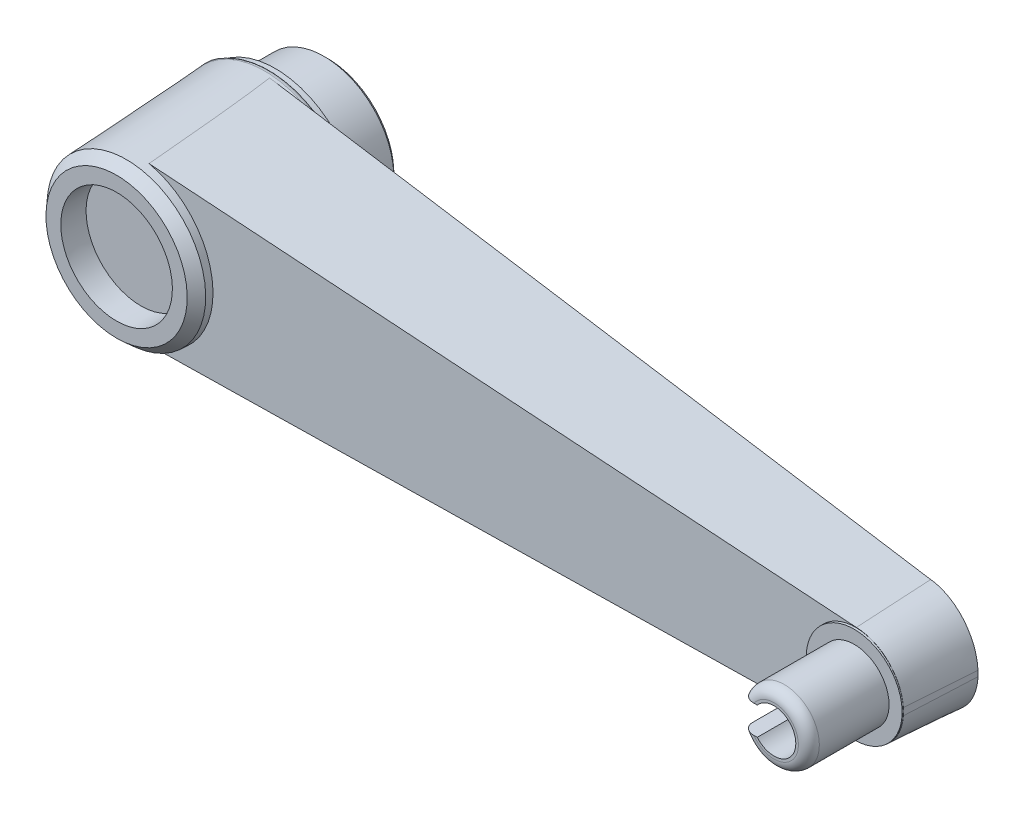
ISO-10303-21;
HEADER;
FILE_DESCRIPTION(('STEP AP214'),'2;1');
FILE_NAME('part.step','',(''),(''),'','','');
FILE_SCHEMA(('AUTOMOTIVE_DESIGN { 1 0 10303 214 1 1 1 1 }'));
ENDSEC;
DATA;
#1=APPLICATION_CONTEXT('core data for automotive mechanical design processes');
#2=APPLICATION_PROTOCOL_DEFINITION('international standard','automotive_design',2000,#1);
#3=PRODUCT_CONTEXT('',#1,'mechanical');
#4=PRODUCT('Part','Part','',(#3));
#5=PRODUCT_RELATED_PRODUCT_CATEGORY('part','',(#4));
#6=PRODUCT_DEFINITION_FORMATION('','',#4);
#7=PRODUCT_DEFINITION_CONTEXT('part definition',#1,'design');
#8=PRODUCT_DEFINITION('design','',#6,#7);
#9=PRODUCT_DEFINITION_SHAPE('','',#8);
#10=(LENGTH_UNIT() NAMED_UNIT(*) SI_UNIT(.MILLI.,.METRE.));
#11=(NAMED_UNIT(*) PLANE_ANGLE_UNIT() SI_UNIT($,.RADIAN.));
#12=(NAMED_UNIT(*) SI_UNIT($,.STERADIAN.) SOLID_ANGLE_UNIT());
#13=UNCERTAINTY_MEASURE_WITH_UNIT(LENGTH_MEASURE(1.E-05),#10,'distance_accuracy_value','');
#14=(GEOMETRIC_REPRESENTATION_CONTEXT(3) GLOBAL_UNCERTAINTY_ASSIGNED_CONTEXT((#13)) GLOBAL_UNIT_ASSIGNED_CONTEXT((#10,
#11,#12)) REPRESENTATION_CONTEXT('',''));
#15=CARTESIAN_POINT('',(0.,0.,0.));
#16=DIRECTION('',(0.,0.,1.));
#17=DIRECTION('',(1.,0.,0.));
#18=AXIS2_PLACEMENT_3D('',#15,#16,#17);
#19=CARTESIAN_POINT('',(212.,0.,69.));
#20=DIRECTION('',(0.,0.,1.));
#21=DIRECTION('',(0.,-1.,0.));
#22=AXIS2_PLACEMENT_3D('',#19,#20,#21);
#23=CYLINDRICAL_SURFACE('',#22,6.25);
#24=CARTESIAN_POINT('',(212.,0.,84.));
#25=DIRECTION('',(0.,0.,1.));
#26=DIRECTION('',(0.,-1.,0.));
#27=AXIS2_PLACEMENT_3D('',#24,#25,#26);
#28=CIRCLE('',#27,6.25);
#29=CARTESIAN_POINT('',(207.197656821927,-4.,84.));
#30=VERTEX_POINT('',#29);
#31=CARTESIAN_POINT('',(207.197656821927,4.,84.));
#32=VERTEX_POINT('',#31);
#33=EDGE_CURVE('E123',#30,#32,#28,.T.);
#34=ORIENTED_EDGE('',*,*,#33,.T.);
#35=DIRECTION('',(0.,0.,1.));
#36=VECTOR('',#35,1.);
#37=CARTESIAN_POINT('',(207.197656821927,4.,69.));
#38=LINE('',#37,#36);
#39=CARTESIAN_POINT('',(207.197656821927,4.,69.));
#40=VERTEX_POINT('',#39);
#41=EDGE_CURVE('E130',#40,#32,#38,.T.);
#42=ORIENTED_EDGE('',*,*,#41,.F.);
#43=CARTESIAN_POINT('',(212.,0.,69.));
#44=DIRECTION('',(0.,0.,1.));
#45=DIRECTION('',(0.,-1.,0.));
#46=AXIS2_PLACEMENT_3D('',#43,#44,#45);
#47=CIRCLE('',#46,6.25);
#48=CARTESIAN_POINT('',(207.197656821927,-4.,69.));
#49=VERTEX_POINT('',#48);
#50=EDGE_CURVE('E126',#49,#40,#47,.T.);
#51=ORIENTED_EDGE('',*,*,#50,.F.);
#52=DIRECTION('',(0.,0.,1.));
#53=VECTOR('',#52,1.);
#54=CARTESIAN_POINT('',(207.197656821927,-4.,69.));
#55=LINE('',#54,#53);
#56=EDGE_CURVE('E119',#49,#30,#55,.T.);
#57=ORIENTED_EDGE('',*,*,#56,.T.);
#58=EDGE_LOOP('',(#34,#42,#51,#57));
#59=FACE_BOUND('',#58,.T.);
#60=CARTESIAN_POINT('',(212.,-6.25,72.5));
#61=CARTESIAN_POINT('',(211.890630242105,-6.24999973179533,72.5000003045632));
#62=CARTESIAN_POINT('',(211.781256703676,-6.24710230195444,72.5090007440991));
#63=CARTESIAN_POINT('',(211.565716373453,-6.23582827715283,72.5446647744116));
#64=CARTESIAN_POINT('',(211.459550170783,-6.22745068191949,72.5713315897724));
#65=CARTESIAN_POINT('',(211.25356346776,-6.20612979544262,72.6413311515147));
#66=CARTESIAN_POINT('',(211.153733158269,-6.19319377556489,72.6846373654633));
#67=CARTESIAN_POINT('',(210.962751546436,-6.16408627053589,72.7865710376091));
#68=CARTESIAN_POINT('',(210.871601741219,-6.14791422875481,72.8452011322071));
#69=CARTESIAN_POINT('',(210.697631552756,-6.11346334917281,72.9781051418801));
#70=CARTESIAN_POINT('',(210.615129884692,-6.09513697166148,73.0527838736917));
#71=CARTESIAN_POINT('',(210.463582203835,-6.05871332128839,73.2148038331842));
#72=CARTESIAN_POINT('',(210.394538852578,-6.04061609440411,73.3021475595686));
#73=CARTESIAN_POINT('',(210.270107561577,-6.00618513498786,73.489816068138));
#74=CARTESIAN_POINT('',(210.215123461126,-5.98990982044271,73.5904203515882));
#75=CARTESIAN_POINT('',(210.122988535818,-5.96168322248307,73.8000529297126));
#76=CARTESIAN_POINT('',(210.085832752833,-5.9497307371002,73.9090788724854));
#77=CARTESIAN_POINT('',(210.031585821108,-5.93200153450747,74.1288532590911));
#78=CARTESIAN_POINT('',(210.01390128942,-5.9260426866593,74.2394401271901));
#79=CARTESIAN_POINT('',(209.997244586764,-5.9204353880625,74.4621594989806));
#80=CARTESIAN_POINT('',(209.998267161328,-5.92078516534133,74.574291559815));
#81=CARTESIAN_POINT('',(210.018532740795,-5.92759523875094,74.7919569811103));
#82=CARTESIAN_POINT('',(210.037014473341,-5.93380021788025,74.8975705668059));
#83=CARTESIAN_POINT('',(210.090436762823,-5.95120571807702,75.1041110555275));
#84=CARTESIAN_POINT('',(210.125379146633,-5.96240679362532,75.2050374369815));
#85=CARTESIAN_POINT('',(210.211254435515,-5.9887331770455,75.4011223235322));
#86=CARTESIAN_POINT('',(210.262421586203,-6.00391536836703,75.4961702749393));
#87=CARTESIAN_POINT('',(210.379131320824,-6.03646806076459,75.6765775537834));
#88=CARTESIAN_POINT('',(210.444677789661,-6.05383915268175,75.7619342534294));
#89=CARTESIAN_POINT('',(210.591993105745,-6.0898296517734,75.9248308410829));
#90=CARTESIAN_POINT('',(210.674388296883,-6.10846901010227,76.0018009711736));
#91=CARTESIAN_POINT('',(210.851148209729,-6.14416460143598,76.1409733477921));
#92=CARTESIAN_POINT('',(210.945513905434,-6.16122070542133,76.2031743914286));
#93=CARTESIAN_POINT('',(211.14467302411,-6.19202237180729,76.3114543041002));
#94=CARTESIAN_POINT('',(211.249548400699,-6.20573850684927,76.3573913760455));
#95=CARTESIAN_POINT('',(211.466080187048,-6.22810201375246,76.4307994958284));
#96=CARTESIAN_POINT('',(211.577734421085,-6.23675100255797,76.458276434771));
#97=CARTESIAN_POINT('',(211.799822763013,-6.24774280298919,76.4930000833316));
#98=CARTESIAN_POINT('',(211.910124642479,-6.25032575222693,76.5010175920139));
#99=CARTESIAN_POINT('',(212.130512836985,-6.24960819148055,76.4987759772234));
#100=CARTESIAN_POINT('',(212.240599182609,-6.24630858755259,76.4885196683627));
#101=CARTESIAN_POINT('',(212.454418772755,-6.23435475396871,76.4506373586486));
#102=CARTESIAN_POINT('',(212.558242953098,-6.22584358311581,76.4234751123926));
#103=CARTESIAN_POINT('',(212.759827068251,-6.20446982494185,76.3531227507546));
#104=CARTESIAN_POINT('',(212.857586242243,-6.19160669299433,76.3099306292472));
#105=CARTESIAN_POINT('',(213.046996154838,-6.16244413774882,76.2075362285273));
#106=CARTESIAN_POINT('',(213.138432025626,-6.14606657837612,76.1479593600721));
#107=CARTESIAN_POINT('',(213.310264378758,-6.11174260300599,76.0149326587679));
#108=CARTESIAN_POINT('',(213.390657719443,-6.09379574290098,75.9414788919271));
#109=CARTESIAN_POINT('',(213.541604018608,-6.05741209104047,75.7791573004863));
#110=CARTESIAN_POINT('',(213.611607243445,-6.03898605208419,75.6897746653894));
#111=CARTESIAN_POINT('',(213.735676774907,-6.00450553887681,75.5001316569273));
#112=CARTESIAN_POINT('',(213.78974321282,-5.98845104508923,75.3998713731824));
#113=CARTESIAN_POINT('',(213.880094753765,-5.96070328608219,75.1914455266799));
#114=CARTESIAN_POINT('',(213.916438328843,-5.94899571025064,75.0833073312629));
#115=CARTESIAN_POINT('',(213.970258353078,-5.9313910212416,74.8619909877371));
#116=CARTESIAN_POINT('',(213.987742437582,-5.92549155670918,74.74881489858));
#117=CARTESIAN_POINT('',(214.002781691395,-5.92042409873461,74.526405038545));
#118=CARTESIAN_POINT('',(214.001242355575,-5.92095023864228,74.4172387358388));
#119=CARTESIAN_POINT('',(213.980479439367,-5.92792698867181,74.2008037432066));
#120=CARTESIAN_POINT('',(213.961256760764,-5.9343772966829,74.0935349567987));
#121=CARTESIAN_POINT('',(213.906291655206,-5.9522567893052,73.8856457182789));
#122=CARTESIAN_POINT('',(213.870820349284,-5.96360409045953,73.7849460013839));
#123=CARTESIAN_POINT('',(213.784580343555,-5.98997469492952,73.590847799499));
#124=CARTESIAN_POINT('',(213.733808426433,-6.00499877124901,73.4974508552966));
#125=CARTESIAN_POINT('',(213.615990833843,-6.03779367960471,73.316487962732));
#126=CARTESIAN_POINT('',(213.548366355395,-6.05565148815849,73.2293146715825));
#127=CARTESIAN_POINT('',(213.399767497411,-6.09171476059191,73.0672603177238));
#128=CARTESIAN_POINT('',(213.318789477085,-6.1099203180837,72.9923826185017));
#129=CARTESIAN_POINT('',(213.142390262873,-6.14538885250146,72.8544271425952));
#130=CARTESIAN_POINT('',(213.046564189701,-6.16259689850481,72.7918513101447));
#131=CARTESIAN_POINT('',(212.845204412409,-6.19342234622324,72.6837747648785));
#132=CARTESIAN_POINT('',(212.73967407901,-6.20704098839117,72.6382681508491));
#133=CARTESIAN_POINT('',(212.529579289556,-6.22835426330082,72.568440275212));
#134=CARTESIAN_POINT('',(212.425470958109,-6.23639876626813,72.5428519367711));
#135=CARTESIAN_POINT('',(212.214242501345,-6.24722116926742,72.50863357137));
#136=CARTESIAN_POINT('',(212.107123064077,-6.25000026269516,72.4999997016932));
#137=CARTESIAN_POINT('',(212.,-6.25,72.5));
#138=B_SPLINE_CURVE_WITH_KNOTS('',3,(#60,#61,#62,#63,#64,#65,#66,#67,#68,#69,#70,#71,#72,#73,
#74,#75,#76,#77,#78,#79,#80,#81,#82,#83,#84,#85,#86,#87,#88,#89,#90,#91,#92,#93,#94,#95,#96,#97,
#98,#99,#100,#101,#102,#103,#104,#105,#106,#107,#108,#109,#110,#111,#112,#113,#114,#115,#116,
#117,#118,#119,#120,#121,#122,#123,#124,#125,#126,#127,#128,#129,#130,#131,#132,#133,#134,#135,
#136,#137),.UNSPECIFIED.,.T.,.F.,(4,2,2,2,2,2,2,2,2,2,2,2,2,2,2,2,2,2,2,2,2,2,2,2,2,2,2,2,2,2,2,
2,2,2,2,2,2,2,4),(0.,0.327715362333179,0.655490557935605,0.982745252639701,1.31005628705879,
1.64687147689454,1.98375320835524,2.32943536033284,2.67502132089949,3.00975612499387,
3.34439690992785,3.66508861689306,3.98581592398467,4.31140244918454,4.63707704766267,
4.97834106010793,5.31963285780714,5.66383089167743,6.00791903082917,6.33813763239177,
6.66830537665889,6.98979270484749,7.31132028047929,7.64091693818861,7.97060717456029,
8.31403741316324,8.65746482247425,8.99975138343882,9.34189931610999,9.66782668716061,
9.9937374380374,10.3143977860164,10.6351256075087,10.968921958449,11.3028094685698,
11.6483285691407,11.9937281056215,12.3147842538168,12.6357676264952),.UNSPECIFIED.);
#139=CARTESIAN_POINT('',(212.,-6.25,72.5));
#140=VERTEX_POINT('',#139);
#141=EDGE_CURVE('E28',#140,#140,#138,.T.);
#142=ORIENTED_EDGE('',*,*,#141,.F.);
#143=EDGE_LOOP('',(#142));
#144=FACE_BOUND('',#143,.T.);
#145=CARTESIAN_POINT('',(212.,6.25,72.5));
#146=CARTESIAN_POINT('',(212.109369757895,6.24999973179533,72.5000003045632));
#147=CARTESIAN_POINT('',(212.218743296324,6.24710230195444,72.5090007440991));
#148=CARTESIAN_POINT('',(212.434283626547,6.23582827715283,72.5446647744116));
#149=CARTESIAN_POINT('',(212.540449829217,6.22745068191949,72.5713315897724));
#150=CARTESIAN_POINT('',(212.74643653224,6.20612979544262,72.6413311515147));
#151=CARTESIAN_POINT('',(212.846266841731,6.19319377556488,72.6846373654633));
#152=CARTESIAN_POINT('',(213.037248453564,6.16408627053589,72.7865710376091));
#153=CARTESIAN_POINT('',(213.128398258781,6.14791422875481,72.8452011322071));
#154=CARTESIAN_POINT('',(213.302368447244,6.11346334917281,72.9781051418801));
#155=CARTESIAN_POINT('',(213.384870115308,6.09513697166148,73.0527838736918));
#156=CARTESIAN_POINT('',(213.536417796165,6.05871332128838,73.2148038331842));
#157=CARTESIAN_POINT('',(213.605461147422,6.04061609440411,73.3021475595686));
#158=CARTESIAN_POINT('',(213.729892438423,6.00618513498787,73.489816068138));
#159=CARTESIAN_POINT('',(213.784876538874,5.98990982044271,73.5904203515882));
#160=CARTESIAN_POINT('',(213.877011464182,5.96168322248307,73.8000529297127));
#161=CARTESIAN_POINT('',(213.914167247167,5.9497307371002,73.9090788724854));
#162=CARTESIAN_POINT('',(213.968414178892,5.93200153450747,74.1288532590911));
#163=CARTESIAN_POINT('',(213.98609871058,5.9260426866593,74.2394401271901));
#164=CARTESIAN_POINT('',(214.002755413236,5.9204353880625,74.4621594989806));
#165=CARTESIAN_POINT('',(214.001732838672,5.92078516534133,74.574291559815));
#166=CARTESIAN_POINT('',(213.981467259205,5.92759523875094,74.7919569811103));
#167=CARTESIAN_POINT('',(213.962985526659,5.93380021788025,74.8975705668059));
#168=CARTESIAN_POINT('',(213.909563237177,5.95120571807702,75.1041110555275));
#169=CARTESIAN_POINT('',(213.874620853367,5.96240679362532,75.2050374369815));
#170=CARTESIAN_POINT('',(213.788745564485,5.9887331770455,75.4011223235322));
#171=CARTESIAN_POINT('',(213.737578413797,6.00391536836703,75.4961702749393));
#172=CARTESIAN_POINT('',(213.620868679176,6.03646806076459,75.6765775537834));
#173=CARTESIAN_POINT('',(213.555322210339,6.05383915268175,75.7619342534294));
#174=CARTESIAN_POINT('',(213.408006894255,6.08982965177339,75.9248308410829));
#175=CARTESIAN_POINT('',(213.325611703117,6.10846901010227,76.0018009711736));
#176=CARTESIAN_POINT('',(213.148851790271,6.14416460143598,76.1409733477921));
#177=CARTESIAN_POINT('',(213.054486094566,6.16122070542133,76.2031743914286));
#178=CARTESIAN_POINT('',(212.85532697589,6.19202237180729,76.3114543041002));
#179=CARTESIAN_POINT('',(212.750451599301,6.20573850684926,76.3573913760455));
#180=CARTESIAN_POINT('',(212.533919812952,6.22810201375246,76.4307994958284));
#181=CARTESIAN_POINT('',(212.422265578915,6.23675100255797,76.458276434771));
#182=CARTESIAN_POINT('',(212.200177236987,6.24774280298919,76.4930000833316));
#183=CARTESIAN_POINT('',(212.089875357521,6.25032575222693,76.5010175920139));
#184=CARTESIAN_POINT('',(211.869487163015,6.24960819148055,76.4987759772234));
#185=CARTESIAN_POINT('',(211.759400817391,6.24630858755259,76.4885196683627));
#186=CARTESIAN_POINT('',(211.545581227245,6.23435475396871,76.4506373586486));
#187=CARTESIAN_POINT('',(211.441757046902,6.22584358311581,76.4234751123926));
#188=CARTESIAN_POINT('',(211.240172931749,6.20446982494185,76.3531227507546));
#189=CARTESIAN_POINT('',(211.142413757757,6.19160669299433,76.3099306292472));
#190=CARTESIAN_POINT('',(210.953003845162,6.16244413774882,76.2075362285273));
#191=CARTESIAN_POINT('',(210.861567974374,6.14606657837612,76.1479593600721));
#192=CARTESIAN_POINT('',(210.689735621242,6.11174260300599,76.0149326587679));
#193=CARTESIAN_POINT('',(210.609342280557,6.09379574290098,75.9414788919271));
#194=CARTESIAN_POINT('',(210.458395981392,6.05741209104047,75.7791573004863));
#195=CARTESIAN_POINT('',(210.388392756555,6.03898605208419,75.6897746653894));
#196=CARTESIAN_POINT('',(210.264323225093,6.00450553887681,75.5001316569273));
#197=CARTESIAN_POINT('',(210.21025678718,5.98845104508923,75.3998713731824));
#198=CARTESIAN_POINT('',(210.119905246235,5.96070328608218,75.1914455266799));
#199=CARTESIAN_POINT('',(210.083561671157,5.94899571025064,75.0833073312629));
#200=CARTESIAN_POINT('',(210.029741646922,5.9313910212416,74.8619909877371));
#201=CARTESIAN_POINT('',(210.012257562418,5.92549155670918,74.74881489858));
#202=CARTESIAN_POINT('',(209.997218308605,5.92042409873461,74.526405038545));
#203=CARTESIAN_POINT('',(209.998757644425,5.92095023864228,74.4172387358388));
#204=CARTESIAN_POINT('',(210.019520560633,5.92792698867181,74.2008037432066));
#205=CARTESIAN_POINT('',(210.038743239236,5.9343772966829,74.0935349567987));
#206=CARTESIAN_POINT('',(210.093708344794,5.9522567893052,73.8856457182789));
#207=CARTESIAN_POINT('',(210.129179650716,5.96360409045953,73.7849460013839));
#208=CARTESIAN_POINT('',(210.215419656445,5.98997469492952,73.590847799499));
#209=CARTESIAN_POINT('',(210.266191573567,6.00499877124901,73.4974508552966));
#210=CARTESIAN_POINT('',(210.384009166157,6.03779367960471,73.316487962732));
#211=CARTESIAN_POINT('',(210.451633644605,6.05565148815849,73.2293146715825));
#212=CARTESIAN_POINT('',(210.600232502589,6.0917147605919,73.0672603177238));
#213=CARTESIAN_POINT('',(210.681210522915,6.1099203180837,72.9923826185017));
#214=CARTESIAN_POINT('',(210.857609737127,6.14538885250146,72.8544271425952));
#215=CARTESIAN_POINT('',(210.953435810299,6.16259689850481,72.7918513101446));
#216=CARTESIAN_POINT('',(211.154795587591,6.19342234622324,72.6837747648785));
#217=CARTESIAN_POINT('',(211.26032592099,6.20704098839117,72.6382681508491));
#218=CARTESIAN_POINT('',(211.470420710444,6.22835426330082,72.568440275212));
#219=CARTESIAN_POINT('',(211.574529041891,6.23639876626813,72.5428519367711));
#220=CARTESIAN_POINT('',(211.785757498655,6.24722116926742,72.50863357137));
#221=CARTESIAN_POINT('',(211.892876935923,6.25000026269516,72.4999997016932));
#222=CARTESIAN_POINT('',(212.,6.25,72.5));
#223=B_SPLINE_CURVE_WITH_KNOTS('',3,(#145,#146,#147,#148,#149,#150,#151,#152,#153,#154,#155,
#156,#157,#158,#159,#160,#161,#162,#163,#164,#165,#166,#167,#168,#169,#170,#171,#172,#173,#174,
#175,#176,#177,#178,#179,#180,#181,#182,#183,#184,#185,#186,#187,#188,#189,#190,#191,#192,#193,
#194,#195,#196,#197,#198,#199,#200,#201,#202,#203,#204,#205,#206,#207,#208,#209,#210,#211,#212,
#213,#214,#215,#216,#217,#218,#219,#220,#221,#222),.UNSPECIFIED.,.T.,.F.,(4,2,2,2,2,2,2,2,2,2,2,
2,2,2,2,2,2,2,2,2,2,2,2,2,2,2,2,2,2,2,2,2,2,2,2,2,2,2,4),(0.,0.327715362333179,
0.655490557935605,0.982745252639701,1.31005628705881,1.64687147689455,1.98375320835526,
2.32943536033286,2.6750213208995,3.00975612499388,3.34439690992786,3.66508861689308,
3.9858159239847,4.31140244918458,4.63707704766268,4.9783410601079,5.31963285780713,
5.66383089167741,6.00791903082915,6.33813763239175,6.6683053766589,6.98979270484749,
7.31132028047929,7.64091693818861,7.97060717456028,8.31403741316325,8.65746482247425,
8.99975138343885,9.34189931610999,9.66782668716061,9.9937374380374,10.3143977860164,
10.6351256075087,10.968921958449,11.3028094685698,11.6483285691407,11.9937281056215,
12.3147842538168,12.6357676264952),.UNSPECIFIED.);
#224=CARTESIAN_POINT('',(212.,6.25,72.5));
#225=VERTEX_POINT('',#224);
#226=EDGE_CURVE('E9',#225,#225,#223,.T.);
#227=ORIENTED_EDGE('',*,*,#226,.F.);
#228=EDGE_LOOP('',(#227));
#229=FACE_BOUND('',#228,.T.);
#230=ADVANCED_FACE('F14',(#59,#144,#229),#23,.F.);
#231=CARTESIAN_POINT('',(-20.25,0.,60.5));
#232=DIRECTION('',(0.,0.,-1.));
#233=DIRECTION('',(0.,1.,0.));
#234=AXIS2_PLACEMENT_3D('',#231,#232,#233);
#235=PLANE('',#234);
#236=CARTESIAN_POINT('',(0.,0.,60.5));
#237=DIRECTION('',(0.,0.,1.));
#238=DIRECTION('',(0.,-1.,0.));
#239=AXIS2_PLACEMENT_3D('',#236,#237,#238);
#240=CIRCLE('',#239,20.25);
#241=CARTESIAN_POINT('',(0.,-20.25,60.5));
#242=VERTEX_POINT('',#241);
#243=EDGE_CURVE('E310',#242,#242,#240,.T.);
#244=ORIENTED_EDGE('',*,*,#243,.T.);
#245=EDGE_LOOP('',(#244));
#246=FACE_BOUND('',#245,.T.);
#247=CARTESIAN_POINT('',(0.,0.,60.5));
#248=DIRECTION('',(0.,0.,1.));
#249=DIRECTION('',(0.,-1.,0.));
#250=AXIS2_PLACEMENT_3D('',#247,#248,#249);
#251=CIRCLE('',#250,16.);
#252=CARTESIAN_POINT('',(0.,-16.,60.5));
#253=VERTEX_POINT('',#252);
#254=EDGE_CURVE('E274',#253,#253,#251,.T.);
#255=ORIENTED_EDGE('',*,*,#254,.F.);
#256=EDGE_LOOP('',(#255));
#257=FACE_BOUND('',#256,.T.);
#258=ADVANCED_FACE('F228',(#246,#257),#235,.F.);
#259=CARTESIAN_POINT('',(-25.,-25.,16.30400452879));
#260=DIRECTION('',(-0.0955561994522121,0.,0.995424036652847));
#261=DIRECTION('',(-0.995424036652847,0.,-0.0955561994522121));
#262=AXIS2_PLACEMENT_3D('',#259,#260,#261);
#263=PLANE('',#262);
#264=DIRECTION('',(0.994379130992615,0.0458073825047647,0.095455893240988));
#265=VECTOR('',#264,1.);
#266=CARTESIAN_POINT('',(-24.9540418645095,-26.0068451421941,16.3084163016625));
#267=LINE('',#266,#265);
#268=CARTESIAN_POINT('',(211.973322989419,-15.0924744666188,39.0523703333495));
#269=VERTEX_POINT('',#268);
#270=CARTESIAN_POINT('',(2.29174502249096,-24.7517321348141,18.923888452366));
#271=VERTEX_POINT('',#270);
#272=EDGE_CURVE('E371',#269,#271,#267,.F.);
#273=ORIENTED_EDGE('',*,*,#272,.T.);
#274=CARTESIAN_POINT('',(-0.129764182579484,0.,18.691434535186));
#275=DIRECTION('',(-0.0955561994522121,0.,0.995424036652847));
#276=DIRECTION('',(-0.995424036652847,0.,-0.0955561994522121));
#277=AXIS2_PLACEMENT_3D('',#274,#275,#276);
#278=ELLIPSE('',#277,24.9845642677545,24.8698972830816);
#279=CARTESIAN_POINT('',(2.29174502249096,24.7517321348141,18.923888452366));
#280=VERTEX_POINT('',#279);
#281=EDGE_CURVE('E319',#271,#280,#278,.T.);
#282=ORIENTED_EDGE('',*,*,#281,.T.);
#283=DIRECTION('',(-0.994379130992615,0.0458073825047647,-0.095455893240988));
#284=VECTOR('',#283,1.);
#285=CARTESIAN_POINT('',(-22.6765466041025,25.9019293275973,16.5270455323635));
#286=LINE('',#285,#284);
#287=CARTESIAN_POINT('',(211.973322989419,15.0924744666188,39.0523703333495));
#288=VERTEX_POINT('',#287);
#289=EDGE_CURVE('E338',#280,#288,#286,.F.);
#290=ORIENTED_EDGE('',*,*,#289,.T.);
#291=CARTESIAN_POINT('',(211.913922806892,0.,39.046668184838));
#292=DIRECTION('',(-0.0955561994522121,0.,0.995424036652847));
#293=DIRECTION('',(-0.995424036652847,0.,-0.0955561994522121));
#294=AXIS2_PLACEMENT_3D('',#291,#292,#293);
#295=ELLIPSE('',#294,15.1622185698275,15.0925913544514);
#296=CARTESIAN_POINT('',(226.986006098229,0.791206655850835,40.4935199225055));
#297=VERTEX_POINT('',#296);
#298=EDGE_CURVE('E198',#297,#288,#295,.T.);
#299=ORIENTED_EDGE('',*,*,#298,.F.);
#300=DIRECTION('',(0.,1.,0.));
#301=VECTOR('',#300,1.);
#302=CARTESIAN_POINT('',(226.986006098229,-25.,40.4935199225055));
#303=LINE('',#302,#301);
#304=CARTESIAN_POINT('',(226.986006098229,-0.791206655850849,40.4935199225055));
#305=VERTEX_POINT('',#304);
#306=EDGE_CURVE('E363',#305,#297,#303,.T.);
#307=ORIENTED_EDGE('',*,*,#306,.F.);
#308=EDGE_CURVE('E350',#269,#305,#295,.T.);
#309=ORIENTED_EDGE('',*,*,#308,.F.);
#310=EDGE_LOOP('',(#273,#282,#290,#299,#307,#309));
#311=FACE_BOUND('',#310,.T.);
#312=ADVANCED_FACE('F184',(#311),#263,.F.);
#313=CARTESIAN_POINT('',(0.,-25.,16.30400452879));
#314=DIRECTION('',(0.0402546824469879,-0.997427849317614,0.0593063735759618));
#315=DIRECTION('',(0.,-0.0593544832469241,-0.998236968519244));
#316=AXIS2_PLACEMENT_3D('',#313,#314,#315);
#317=PLANE('',#316);
#318=DIRECTION('',(-0.998829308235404,-0.0417626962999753,-0.0244108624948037));
#319=VECTOR('',#318,1.);
#320=CARTESIAN_POINT('',(225.279604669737,-13.2706431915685,60.660589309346));
#321=LINE('',#320,#319);
#322=CARTESIAN_POINT('',(4.05779145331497,-22.5202910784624,55.25404464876));
#323=VERTEX_POINT('',#322);
#324=CARTESIAN_POINT('',(211.949517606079,-13.8279960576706,60.3348089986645));
#325=VERTEX_POINT('',#324);
#326=EDGE_CURVE('E356',#323,#325,#321,.F.);
#327=ORIENTED_EDGE('',*,*,#326,.F.);
#328=CARTESIAN_POINT('',(0.485870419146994,-12.0388649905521,233.957482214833));
#329=DIRECTION('',(0.0402546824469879,-0.997427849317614,0.0593063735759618));
#330=DIRECTION('',(0.00239156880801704,-0.059258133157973,-0.998239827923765));
#331=AXIS2_PLACEMENT_3D('',#328,#329,#330);
#332=ELLIPSE('',#331,222.064873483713,5.31741796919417);
#333=EDGE_CURVE('E316',#323,#271,#332,.F.);
#334=ORIENTED_EDGE('',*,*,#333,.T.);
#335=ORIENTED_EDGE('',*,*,#272,.F.);
#336=CARTESIAN_POINT('',(211.949149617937,-13.807928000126,60.6725678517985));
#337=CARTESIAN_POINT('',(211.958621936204,-14.3233358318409,51.9978943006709));
#338=CARTESIAN_POINT('',(211.968369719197,-14.8387325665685,43.3232204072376));
#339=CARTESIAN_POINT('',(211.985458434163,-15.7174176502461,28.5336991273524));
#340=CARTESIAN_POINT('',(211.992660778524,-16.0807115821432,22.4188519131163));
#341=CARTESIAN_POINT('',(212.,-16.444,16.30400452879));
#342=B_SPLINE_CURVE_WITH_KNOTS('',3,(#336,#337,#338,#339,#340,#341),.UNSPECIFIED.,.F.,.F.,(4,2,
4),(0.,26.069930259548,44.4468319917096),.UNSPECIFIED.);
#343=EDGE_CURVE('E189',#325,#269,#342,.T.);
#344=ORIENTED_EDGE('',*,*,#343,.F.);
#345=EDGE_LOOP('',(#327,#334,#335,#344));
#346=FACE_BOUND('',#345,.T.);
#347=ADVANCED_FACE('F179',(#346),#317,.T.);
#348=CARTESIAN_POINT('',(212.,16.444,16.30400452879));
#349=DIRECTION('',(0.0402546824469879,0.997427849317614,0.0593063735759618));
#350=DIRECTION('',(0.,-0.0593544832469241,0.998236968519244));
#351=AXIS2_PLACEMENT_3D('',#348,#349,#350);
#352=PLANE('',#351);
#353=ORIENTED_EDGE('',*,*,#289,.F.);
#354=CARTESIAN_POINT('',(0.485870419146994,12.0388649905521,233.957482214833));
#355=DIRECTION('',(0.0402546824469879,0.997427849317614,0.0593063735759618));
#356=DIRECTION('',(0.00239156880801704,0.059258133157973,-0.998239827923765));
#357=AXIS2_PLACEMENT_3D('',#354,#355,#356);
#358=ELLIPSE('',#357,222.064873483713,5.31741796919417);
#359=CARTESIAN_POINT('',(4.05779145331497,22.5202910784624,55.25404464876));
#360=VERTEX_POINT('',#359);
#361=EDGE_CURVE('E313',#280,#360,#358,.F.);
#362=ORIENTED_EDGE('',*,*,#361,.T.);
#363=DIRECTION('',(0.998829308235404,-0.0417626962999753,0.0244108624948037));
#364=VECTOR('',#363,1.);
#365=CARTESIAN_POINT('',(227.365294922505,13.1834370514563,60.7115624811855));
#366=LINE('',#365,#364);
#367=CARTESIAN_POINT('',(211.949517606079,13.8279960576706,60.3348089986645));
#368=VERTEX_POINT('',#367);
#369=EDGE_CURVE('E340',#368,#360,#366,.F.);
#370=ORIENTED_EDGE('',*,*,#369,.F.);
#371=CARTESIAN_POINT('',(211.949149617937,13.807928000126,60.6725678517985));
#372=CARTESIAN_POINT('',(211.958621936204,14.3233358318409,51.9978943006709));
#373=CARTESIAN_POINT('',(211.968369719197,14.8387325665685,43.3232204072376));
#374=CARTESIAN_POINT('',(211.985458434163,15.7174176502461,28.5336991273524));
#375=CARTESIAN_POINT('',(211.992660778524,16.0807115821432,22.4188519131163));
#376=CARTESIAN_POINT('',(212.,16.444,16.30400452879));
#377=B_SPLINE_CURVE_WITH_KNOTS('',3,(#371,#372,#373,#374,#375,#376),.UNSPECIFIED.,.F.,.F.,(4,2,
4),(0.,26.069930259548,44.4468319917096),.UNSPECIFIED.);
#378=EDGE_CURVE('E199',#368,#288,#377,.T.);
#379=ORIENTED_EDGE('',*,*,#378,.T.);
#380=EDGE_LOOP('',(#353,#362,#370,#379));
#381=FACE_BOUND('',#380,.T.);
#382=ADVANCED_FACE('F183',(#381),#352,.T.);
#383=CARTESIAN_POINT('',(212.,0.,16.30400452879));
#384=DIRECTION('',(0.,0.,-1.));
#385=DIRECTION('',(0.,1.,0.));
#386=AXIS2_PLACEMENT_3D('',#383,#384,#385);
#387=CONICAL_SURFACE('',#386,16.444,0.0593411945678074);
#388=CARTESIAN_POINT('',(220.16260637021,0.,153.700008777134));
#389=DIRECTION('',(-0.998188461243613,0.,-0.0601647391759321));
#390=DIRECTION('',(0.0601647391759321,0.,-0.998188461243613));
#391=AXIS2_PLACEMENT_3D('',#388,#389,#390);
#392=ELLIPSE('',#391,137.641638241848,1.3963122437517);
#393=CARTESIAN_POINT('',(225.769735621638,-1.02754188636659,60.6725678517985));
#394=VERTEX_POINT('',#393);
#395=EDGE_CURVE('E366',#305,#394,#392,.T.);
#396=ORIENTED_EDGE('',*,*,#395,.T.);
#397=CARTESIAN_POINT('',(211.979922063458,0.,60.3355520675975));
#398=DIRECTION('',(0.0244321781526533,0.,-0.999701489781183));
#399=DIRECTION('',(-0.999701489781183,0.,-0.0244321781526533));
#400=AXIS2_PLACEMENT_3D('',#397,#398,#399);
#401=ELLIPSE('',#400,13.8321731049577,13.8280294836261);
#402=EDGE_CURVE('E351',#394,#325,#401,.T.);
#403=ORIENTED_EDGE('',*,*,#402,.T.);
#404=ORIENTED_EDGE('',*,*,#343,.T.);
#405=ORIENTED_EDGE('',*,*,#308,.T.);
#406=EDGE_LOOP('',(#396,#403,#404,#405));
#407=FACE_BOUND('',#406,.T.);
#408=ADVANCED_FACE('F206',(#407),#387,.T.);
#409=ORIENTED_EDGE('',*,*,#378,.F.);
#410=CARTESIAN_POINT('',(225.769735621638,1.02754188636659,60.6725678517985));
#411=VERTEX_POINT('',#410);
#412=EDGE_CURVE('E345',#368,#411,#401,.T.);
#413=ORIENTED_EDGE('',*,*,#412,.T.);
#414=EDGE_CURVE('E347',#411,#297,#392,.T.);
#415=ORIENTED_EDGE('',*,*,#414,.T.);
#416=ORIENTED_EDGE('',*,*,#298,.T.);
#417=EDGE_LOOP('',(#409,#413,#415,#416));
#418=FACE_BOUND('',#417,.T.);
#419=ADVANCED_FACE('F210',(#418),#387,.T.);
#420=CARTESIAN_POINT('',(225.769735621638,-25.,60.6725678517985));
#421=DIRECTION('',(0.0244321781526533,0.,-0.999701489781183));
#422=DIRECTION('',(0.999701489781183,0.,0.0244321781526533));
#423=AXIS2_PLACEMENT_3D('',#420,#421,#422);
#424=PLANE('',#423);
#425=CARTESIAN_POINT('',(212.,0.,60.3360427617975));
#426=DIRECTION('',(0.0244321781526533,0.,-0.999701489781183));
#427=DIRECTION('',(0.999701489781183,0.,0.0244321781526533));
#428=AXIS2_PLACEMENT_3D('',#425,#426,#427);
#429=ELLIPSE('',#428,13.7541057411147,13.7500000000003);
#430=CARTESIAN_POINT('',(225.75,0.,60.6720855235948));
#431=VERTEX_POINT('',#430);
#432=EDGE_CURVE('E374',#431,#431,#429,.T.);
#433=ORIENTED_EDGE('',*,*,#432,.T.);
#434=EDGE_LOOP('',(#433));
#435=FACE_BOUND('',#434,.T.);
#436=ORIENTED_EDGE('',*,*,#369,.T.);
#437=CARTESIAN_POINT('',(-0.0304040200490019,0.,55.154131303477));
#438=DIRECTION('',(0.0244321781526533,0.,-0.999701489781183));
#439=DIRECTION('',(-0.999701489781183,0.,-0.0244321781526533));
#440=AXIS2_PLACEMENT_3D('',#437,#438,#439);
#441=ELLIPSE('',#440,22.8952102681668,22.8883556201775);
#442=EDGE_CURVE('E377',#360,#323,#441,.T.);
#443=ORIENTED_EDGE('',*,*,#442,.T.);
#444=ORIENTED_EDGE('',*,*,#326,.T.);
#445=ORIENTED_EDGE('',*,*,#402,.F.);
#446=DIRECTION('',(0.,1.,0.));
#447=VECTOR('',#446,1.);
#448=CARTESIAN_POINT('',(225.769735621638,-25.,60.6725678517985));
#449=LINE('',#448,#447);
#450=EDGE_CURVE('E360',#394,#411,#449,.T.);
#451=ORIENTED_EDGE('',*,*,#450,.T.);
#452=ORIENTED_EDGE('',*,*,#412,.F.);
#453=EDGE_LOOP('',(#436,#443,#444,#445,#451,#452));
#454=FACE_BOUND('',#453,.T.);
#455=ADVANCED_FACE('F213',(#435,#454),#424,.F.);
#456=CARTESIAN_POINT('',(226.986006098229,-25.,40.4935199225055));
#457=DIRECTION('',(-0.998188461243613,0.,-0.0601647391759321));
#458=DIRECTION('',(0.0601647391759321,0.,-0.998188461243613));
#459=AXIS2_PLACEMENT_3D('',#456,#457,#458);
#460=PLANE('',#459);
#461=ORIENTED_EDGE('',*,*,#395,.F.);
#462=ORIENTED_EDGE('',*,*,#306,.T.);
#463=ORIENTED_EDGE('',*,*,#414,.F.);
#464=ORIENTED_EDGE('',*,*,#450,.F.);
#465=EDGE_LOOP('',(#461,#462,#463,#464));
#466=FACE_BOUND('',#465,.T.);
#467=ADVANCED_FACE('F216',(#466),#460,.F.);
#468=CARTESIAN_POINT('',(212.,0.,89.2329567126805));
#469=DIRECTION('',(0.,0.,1.));
#470=DIRECTION('',(0.,-1.,0.));
#471=AXIS2_PLACEMENT_3D('',#468,#469,#470);
#472=CYLINDRICAL_SURFACE('',#471,13.7500000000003);
#473=CARTESIAN_POINT('',(212.,0.,61.));
#474=DIRECTION('',(0.,0.,1.));
#475=DIRECTION('',(0.,-1.,0.));
#476=AXIS2_PLACEMENT_3D('',#473,#474,#475);
#477=CIRCLE('',#476,13.7500000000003);
#478=CARTESIAN_POINT('',(212.,-13.7500000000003,61.));
#479=VERTEX_POINT('',#478);
#480=EDGE_CURVE('E324',#479,#479,#477,.T.);
#481=ORIENTED_EDGE('',*,*,#480,.F.);
#482=EDGE_LOOP('',(#481));
#483=FACE_BOUND('',#482,.T.);
#484=ORIENTED_EDGE('',*,*,#432,.F.);
#485=EDGE_LOOP('',(#484));
#486=FACE_BOUND('',#485,.T.);
#487=ADVANCED_FACE('F178',(#483,#486),#472,.T.);
#488=CARTESIAN_POINT('',(205.,0.,84.));
#489=DIRECTION('',(0.,0.,-1.));
#490=DIRECTION('',(0.,1.,0.));
#491=AXIS2_PLACEMENT_3D('',#488,#489,#490);
#492=PLANE('',#491);
#493=CARTESIAN_POINT('',(212.,0.,84.));
#494=DIRECTION('',(0.,0.,1.));
#495=DIRECTION('',(0.,-1.,0.));
#496=AXIS2_PLACEMENT_3D('',#493,#494,#495);
#497=CIRCLE('',#496,7.00000000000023);
#498=CARTESIAN_POINT('',(206.255437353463,-4.,84.));
#499=VERTEX_POINT('',#498);
#500=CARTESIAN_POINT('',(206.255437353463,4.,84.));
#501=VERTEX_POINT('',#500);
#502=EDGE_CURVE('E332',#499,#501,#497,.T.);
#503=ORIENTED_EDGE('',*,*,#502,.T.);
#504=DIRECTION('',(-1.,0.,0.));
#505=VECTOR('',#504,1.);
#506=CARTESIAN_POINT('',(207.197656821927,4.,84.));
#507=LINE('',#506,#505);
#508=EDGE_CURVE('E140',#32,#501,#507,.T.);
#509=ORIENTED_EDGE('',*,*,#508,.F.);
#510=ORIENTED_EDGE('',*,*,#33,.F.);
#511=DIRECTION('',(-1.,0.,0.));
#512=VECTOR('',#511,1.);
#513=CARTESIAN_POINT('',(207.197656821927,-4.,84.));
#514=LINE('',#513,#512);
#515=EDGE_CURVE('E133',#30,#499,#514,.T.);
#516=ORIENTED_EDGE('',*,*,#515,.T.);
#517=EDGE_LOOP('',(#503,#509,#510,#516));
#518=FACE_BOUND('',#517,.T.);
#519=ADVANCED_FACE('F142',(#518),#492,.F.);
#520=CARTESIAN_POINT('',(212.,0.,81.));
#521=DIRECTION('',(0.,0.,1.));
#522=DIRECTION('',(0.,-1.,0.));
#523=AXIS2_PLACEMENT_3D('',#520,#521,#522);
#524=TOROIDAL_SURFACE('',#523,7.00000000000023,3.);
#525=CARTESIAN_POINT('',(204.365394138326,4.,78.474365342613));
#526=CARTESIAN_POINT('',(204.290014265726,4.,78.5171568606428));
#527=CARTESIAN_POINT('',(204.216294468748,4.,78.5628987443));
#528=CARTESIAN_POINT('',(204.072713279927,4.,78.6601444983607));
#529=CARTESIAN_POINT('',(204.002853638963,4.,78.7116509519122));
#530=CARTESIAN_POINT('',(203.867421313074,4.,78.8203916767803));
#531=CARTESIAN_POINT('',(203.801860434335,4.,78.8776407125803));
#532=CARTESIAN_POINT('',(203.675836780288,4.,78.9974495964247));
#533=CARTESIAN_POINT('',(203.615373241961,4.,79.0600086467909));
#534=CARTESIAN_POINT('',(203.442129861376,4.,79.2555991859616));
#535=CARTESIAN_POINT('',(203.337781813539,4.,79.3963171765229));
#536=CARTESIAN_POINT('',(203.15628143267,4.,79.6940362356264));
#537=CARTESIAN_POINT('',(203.07909167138,4.,79.8510145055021));
#538=CARTESIAN_POINT('',(202.958910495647,4.,80.1664103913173));
#539=CARTESIAN_POINT('',(202.914090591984,4.,80.3241311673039));
#540=CARTESIAN_POINT('',(202.853000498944,4.,80.6449774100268));
#541=CARTESIAN_POINT('',(202.836712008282,4.,80.8080993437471));
#542=CARTESIAN_POINT('',(202.833744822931,4.,81.0906880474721));
#543=CARTESIAN_POINT('',(202.840295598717,4.,81.2101278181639));
#544=CARTESIAN_POINT('',(202.868805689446,4.,81.4471351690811));
#545=CARTESIAN_POINT('',(202.890762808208,4.,81.5647030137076));
#546=CARTESIAN_POINT('',(202.960303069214,4.,81.8379274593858));
#547=CARTESIAN_POINT('',(203.014279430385,4.,81.9919948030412));
#548=CARTESIAN_POINT('',(203.147873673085,4.,82.2886617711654));
#549=CARTESIAN_POINT('',(203.22751670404,4.,82.4312499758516));
#550=CARTESIAN_POINT('',(203.409160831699,4.,82.7007693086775));
#551=CARTESIAN_POINT('',(203.511099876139,4.,82.8277423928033));
#552=CARTESIAN_POINT('',(203.733897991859,4.,83.063702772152));
#553=CARTESIAN_POINT('',(203.854754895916,4.,83.1726921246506));
#554=CARTESIAN_POINT('',(204.117905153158,4.,83.3757663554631));
#555=CARTESIAN_POINT('',(204.260955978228,4.,83.4688664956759));
#556=CARTESIAN_POINT('',(204.559464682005,4.,83.6323945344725));
#557=CARTESIAN_POINT('',(204.714928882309,4.,83.702810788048));
#558=CARTESIAN_POINT('',(205.051469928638,4.,83.8272758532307));
#559=CARTESIAN_POINT('',(205.233499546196,4.,83.8787354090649));
#560=CARTESIAN_POINT('',(205.602940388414,4.,83.9547146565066));
#561=CARTESIAN_POINT('',(205.790350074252,4.,83.9792419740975));
#562=CARTESIAN_POINT('',(206.111493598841,4.,83.9997326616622));
#563=CARTESIAN_POINT('',(206.244882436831,4.,84.0019553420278));
#564=CARTESIAN_POINT('',(206.511385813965,4.,83.9946880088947));
#565=CARTESIAN_POINT('',(206.644500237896,4.,83.9851938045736));
#566=CARTESIAN_POINT('',(206.91016085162,4.,83.9552819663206));
#567=CARTESIAN_POINT('',(207.042700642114,4.,83.9348086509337));
#568=CARTESIAN_POINT('',(207.305850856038,4.,83.8838343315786));
#569=CARTESIAN_POINT('',(207.436460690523,4.,83.8533303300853));
#570=CARTESIAN_POINT('',(207.753328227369,4.,83.7674854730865));
#571=CARTESIAN_POINT('',(207.938237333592,4.,83.7071426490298));
#572=CARTESIAN_POINT('',(208.302060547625,4.,83.5701175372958));
#573=CARTESIAN_POINT('',(208.480966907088,4.,83.4934150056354));
#574=CARTESIAN_POINT('',(208.829680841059,4.,83.3276091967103));
#575=CARTESIAN_POINT('',(208.999582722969,4.,83.2387018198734));
#576=CARTESIAN_POINT('',(209.332749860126,4.,83.0502738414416));
#577=CARTESIAN_POINT('',(209.496033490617,4.,82.9507858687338));
#578=CARTESIAN_POINT('',(209.656380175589,4.,82.847033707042));
#579=B_SPLINE_CURVE_WITH_KNOTS('',3,(#525,#526,#527,#528,#529,#530,#531,#532,#533,#534,#535,
#536,#537,#538,#539,#540,#541,#542,#543,#544,#545,#546,#547,#548,#549,#550,#551,#552,#553,#554,
#555,#556,#557,#558,#559,#560,#561,#562,#563,#564,#565,#566,#567,#568,#569,#570,#571,#572,#573,
#574,#575,#576,#577,#578),.UNSPECIFIED.,.F.,.F.,(4,2,2,2,2,2,2,2,2,2,2,2,2,2,2,2,2,2,2,2,2,2,2,
2,2,2,4),(0.,0.259988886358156,0.520094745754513,0.780887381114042,1.04164090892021,
1.56422550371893,2.08608704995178,2.57548908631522,3.06457708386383,3.42247214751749,
3.78031620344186,4.26747748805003,4.75511757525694,5.24141739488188,5.72766154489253,
6.23759342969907,6.74778667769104,7.31308462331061,7.87822246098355,8.27794529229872,
8.67781113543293,9.07972437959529,9.48175783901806,10.0643265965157,10.6476204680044,
11.222458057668,11.7955716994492),.UNSPECIFIED.);
#580=CARTESIAN_POINT('',(202.83484861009,4.,81.));
#581=VERTEX_POINT('',#580);
#582=EDGE_CURVE('E159',#501,#581,#579,.F.);
#583=ORIENTED_EDGE('',*,*,#582,.F.);
#584=ORIENTED_EDGE('',*,*,#502,.F.);
#585=CARTESIAN_POINT('',(204.365394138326,-4.,78.474365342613));
#586=CARTESIAN_POINT('',(204.290014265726,-4.,78.5171568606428));
#587=CARTESIAN_POINT('',(204.216294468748,-4.,78.5628987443));
#588=CARTESIAN_POINT('',(204.072713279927,-4.,78.6601444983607));
#589=CARTESIAN_POINT('',(204.002853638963,-4.,78.7116509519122));
#590=CARTESIAN_POINT('',(203.867421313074,-4.,78.8203916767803));
#591=CARTESIAN_POINT('',(203.801860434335,-4.,78.8776407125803));
#592=CARTESIAN_POINT('',(203.675836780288,-4.,78.9974495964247));
#593=CARTESIAN_POINT('',(203.615373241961,-4.,79.0600086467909));
#594=CARTESIAN_POINT('',(203.442129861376,-4.,79.2555991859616));
#595=CARTESIAN_POINT('',(203.337781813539,-4.,79.3963171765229));
#596=CARTESIAN_POINT('',(203.15628143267,-4.,79.6940362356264));
#597=CARTESIAN_POINT('',(203.07909167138,-4.,79.8510145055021));
#598=CARTESIAN_POINT('',(202.958910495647,-4.,80.1664103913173));
#599=CARTESIAN_POINT('',(202.914090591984,-4.,80.3241311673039));
#600=CARTESIAN_POINT('',(202.853000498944,-4.,80.6449774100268));
#601=CARTESIAN_POINT('',(202.836712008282,-4.,80.8080993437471));
#602=CARTESIAN_POINT('',(202.833744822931,-4.,81.0906880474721));
#603=CARTESIAN_POINT('',(202.840295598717,-4.,81.2101278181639));
#604=CARTESIAN_POINT('',(202.868805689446,-4.,81.4471351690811));
#605=CARTESIAN_POINT('',(202.890762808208,-4.,81.5647030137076));
#606=CARTESIAN_POINT('',(202.960303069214,-4.,81.8379274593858));
#607=CARTESIAN_POINT('',(203.014279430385,-4.,81.9919948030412));
#608=CARTESIAN_POINT('',(203.147873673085,-4.,82.2886617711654));
#609=CARTESIAN_POINT('',(203.22751670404,-4.,82.4312499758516));
#610=CARTESIAN_POINT('',(203.409160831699,-4.,82.7007693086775));
#611=CARTESIAN_POINT('',(203.511099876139,-4.,82.8277423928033));
#612=CARTESIAN_POINT('',(203.733897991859,-4.,83.063702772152));
#613=CARTESIAN_POINT('',(203.854754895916,-4.,83.1726921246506));
#614=CARTESIAN_POINT('',(204.117905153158,-4.,83.3757663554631));
#615=CARTESIAN_POINT('',(204.260955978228,-4.,83.4688664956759));
#616=CARTESIAN_POINT('',(204.559464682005,-4.,83.6323945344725));
#617=CARTESIAN_POINT('',(204.714928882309,-4.,83.702810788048));
#618=CARTESIAN_POINT('',(205.051469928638,-4.,83.8272758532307));
#619=CARTESIAN_POINT('',(205.233499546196,-4.,83.8787354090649));
#620=CARTESIAN_POINT('',(205.602940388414,-4.,83.9547146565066));
#621=CARTESIAN_POINT('',(205.790350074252,-4.,83.9792419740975));
#622=CARTESIAN_POINT('',(206.111493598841,-4.,83.9997326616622));
#623=CARTESIAN_POINT('',(206.244882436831,-4.,84.0019553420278));
#624=CARTESIAN_POINT('',(206.511385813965,-4.,83.9946880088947));
#625=CARTESIAN_POINT('',(206.644500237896,-4.,83.9851938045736));
#626=CARTESIAN_POINT('',(206.91016085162,-4.,83.9552819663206));
#627=CARTESIAN_POINT('',(207.042700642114,-4.,83.9348086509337));
#628=CARTESIAN_POINT('',(207.305850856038,-4.,83.8838343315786));
#629=CARTESIAN_POINT('',(207.436460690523,-4.,83.8533303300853));
#630=CARTESIAN_POINT('',(207.753328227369,-4.,83.7674854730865));
#631=CARTESIAN_POINT('',(207.938237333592,-4.,83.7071426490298));
#632=CARTESIAN_POINT('',(208.302060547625,-4.,83.5701175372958));
#633=CARTESIAN_POINT('',(208.480966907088,-4.,83.4934150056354));
#634=CARTESIAN_POINT('',(208.829680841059,-4.,83.3276091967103));
#635=CARTESIAN_POINT('',(208.999582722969,-4.,83.2387018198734));
#636=CARTESIAN_POINT('',(209.332749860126,-4.,83.0502738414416));
#637=CARTESIAN_POINT('',(209.496033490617,-4.,82.9507858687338));
#638=CARTESIAN_POINT('',(209.656380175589,-4.,82.847033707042));
#639=B_SPLINE_CURVE_WITH_KNOTS('',3,(#585,#586,#587,#588,#589,#590,#591,#592,#593,#594,#595,
#596,#597,#598,#599,#600,#601,#602,#603,#604,#605,#606,#607,#608,#609,#610,#611,#612,#613,#614,
#615,#616,#617,#618,#619,#620,#621,#622,#623,#624,#625,#626,#627,#628,#629,#630,#631,#632,#633,
#634,#635,#636,#637,#638),.UNSPECIFIED.,.F.,.F.,(4,2,2,2,2,2,2,2,2,2,2,2,2,2,2,2,2,2,2,2,2,2,2,
2,2,2,4),(0.,0.259988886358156,0.520094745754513,0.780887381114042,1.04164090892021,
1.56422550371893,2.08608704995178,2.57548908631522,3.06457708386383,3.42247214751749,
3.78031620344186,4.26747748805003,4.75511757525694,5.24141739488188,5.72766154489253,
6.23759342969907,6.74778667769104,7.31308462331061,7.87822246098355,8.27794529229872,
8.67781113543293,9.07972437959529,9.48175783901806,10.0643265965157,10.6476204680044,
11.222458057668,11.7955716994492),.UNSPECIFIED.);
#640=CARTESIAN_POINT('',(202.83484861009,-4.,81.));
#641=VERTEX_POINT('',#640);
#642=EDGE_CURVE('E136',#499,#641,#639,.F.);
#643=ORIENTED_EDGE('',*,*,#642,.T.);
#644=CARTESIAN_POINT('',(212.,0.,81.));
#645=DIRECTION('',(0.,0.,1.));
#646=DIRECTION('',(0.,-1.,0.));
#647=AXIS2_PLACEMENT_3D('',#644,#645,#646);
#648=CIRCLE('',#647,10.0000000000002);
#649=EDGE_CURVE('E330',#641,#581,#648,.T.);
#650=ORIENTED_EDGE('',*,*,#649,.T.);
#651=EDGE_LOOP('',(#583,#584,#643,#650));
#652=FACE_BOUND('',#651,.T.);
#653=ADVANCED_FACE('F167',(#652),#524,.T.);
#654=CARTESIAN_POINT('',(212.,0.,89.2329567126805));
#655=DIRECTION('',(0.,0.,1.));
#656=DIRECTION('',(0.,-1.,0.));
#657=AXIS2_PLACEMENT_3D('',#654,#655,#656);
#658=CYLINDRICAL_SURFACE('',#657,10.0000000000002);
#659=DIRECTION('',(0.,0.,1.));
#660=VECTOR('',#659,1.);
#661=CARTESIAN_POINT('',(202.83484861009,4.,89.2329567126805));
#662=LINE('',#661,#660);
#663=CARTESIAN_POINT('',(202.83484861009,4.,69.));
#664=VERTEX_POINT('',#663);
#665=EDGE_CURVE('E35',#581,#664,#662,.F.);
#666=ORIENTED_EDGE('',*,*,#665,.F.);
#667=ORIENTED_EDGE('',*,*,#649,.F.);
#668=DIRECTION('',(0.,0.,1.));
#669=VECTOR('',#668,1.);
#670=CARTESIAN_POINT('',(202.83484861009,-4.,89.2329567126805));
#671=LINE('',#670,#669);
#672=CARTESIAN_POINT('',(202.83484861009,-4.,69.));
#673=VERTEX_POINT('',#672);
#674=EDGE_CURVE('E452',#641,#673,#671,.F.);
#675=ORIENTED_EDGE('',*,*,#674,.T.);
#676=CARTESIAN_POINT('',(212.,0.,69.));
#677=DIRECTION('',(0.,0.,1.));
#678=DIRECTION('',(0.,-1.,0.));
#679=AXIS2_PLACEMENT_3D('',#676,#677,#678);
#680=CIRCLE('',#679,10.0000000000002);
#681=EDGE_CURVE('E450',#673,#664,#680,.F.);
#682=ORIENTED_EDGE('',*,*,#681,.T.);
#683=EDGE_LOOP('',(#666,#667,#675,#682));
#684=FACE_BOUND('',#683,.T.);
#685=CARTESIAN_POINT('',(212.,0.,61.));
#686=DIRECTION('',(0.,0.,1.));
#687=DIRECTION('',(0.,-1.,0.));
#688=AXIS2_PLACEMENT_3D('',#685,#686,#687);
#689=CIRCLE('',#688,10.0000000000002);
#690=CARTESIAN_POINT('',(212.,-10.0000000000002,61.));
#691=VERTEX_POINT('',#690);
#692=EDGE_CURVE('E327',#691,#691,#689,.T.);
#693=ORIENTED_EDGE('',*,*,#692,.T.);
#694=EDGE_LOOP('',(#693));
#695=FACE_BOUND('',#694,.T.);
#696=ADVANCED_FACE('F172',(#684,#695),#658,.T.);
#697=CARTESIAN_POINT('',(198.25,0.,61.));
#698=DIRECTION('',(0.,0.,-1.));
#699=DIRECTION('',(0.,1.,0.));
#700=AXIS2_PLACEMENT_3D('',#697,#698,#699);
#701=PLANE('',#700);
#702=ORIENTED_EDGE('',*,*,#692,.F.);
#703=EDGE_LOOP('',(#702));
#704=FACE_BOUND('',#703,.T.);
#705=ORIENTED_EDGE('',*,*,#480,.T.);
#706=EDGE_LOOP('',(#705));
#707=FACE_BOUND('',#706,.T.);
#708=ADVANCED_FACE('F400',(#704,#707),#701,.F.);
#709=CARTESIAN_POINT('',(0.,0.,17.963765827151));
#710=DIRECTION('',(0.,0.,1.));
#711=DIRECTION('',(0.,-1.,0.));
#712=AXIS2_PLACEMENT_3D('',#709,#710,#711);
#713=TOROIDAL_SURFACE('',#712,23.4075727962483,1.50000000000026);
#714=CARTESIAN_POINT('',(0.,0.,18.0451752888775));
#715=DIRECTION('',(0.,0.,1.));
#716=DIRECTION('',(0.,-1.,0.));
#717=AXIS2_PLACEMENT_3D('',#714,#715,#716);
#718=CIRCLE('',#717,24.9053620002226);
#719=CARTESIAN_POINT('',(0.,-24.9053620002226,18.0451752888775));
#720=VERTEX_POINT('',#719);
#721=EDGE_CURVE('E304',#720,#720,#718,.T.);
#722=ORIENTED_EDGE('',*,*,#721,.F.);
#723=EDGE_LOOP('',(#722));
#724=FACE_BOUND('',#723,.T.);
#725=CARTESIAN_POINT('',(-6.85986549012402,23.941987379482,18.0453752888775));
#726=CARTESIAN_POINT('',(-7.34033994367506,23.8069453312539,17.9992519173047));
#727=CARTESIAN_POINT('',(-7.81612176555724,23.6553745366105,17.95357901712));
#728=CARTESIAN_POINT('',(-8.7570791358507,23.3198762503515,17.8632513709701));
#729=CARTESIAN_POINT('',(-9.2222370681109,23.1358988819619,17.8185983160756));
#730=CARTESIAN_POINT('',(-10.2574338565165,22.6852527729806,17.7192241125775));
#731=CARTESIAN_POINT('',(-10.8235923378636,22.4094938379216,17.6648754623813));
#732=CARTESIAN_POINT('',(-11.6538558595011,21.9606445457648,17.5851739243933));
#733=CARTESIAN_POINT('',(-11.9275205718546,21.8051120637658,17.5589033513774));
#734=CARTESIAN_POINT('',(-12.468155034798,21.4825644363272,17.5070048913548));
#735=CARTESIAN_POINT('',(-12.7351231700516,21.3155465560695,17.481377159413));
#736=CARTESIAN_POINT('',(-13.5257876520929,20.7974022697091,17.4054769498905));
#737=CARTESIAN_POINT('',(-14.03869919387,20.4294800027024,17.3562397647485));
#738=CARTESIAN_POINT('',(-15.0320674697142,19.6517939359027,17.260880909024));
#739=CARTESIAN_POINT('',(-15.5125236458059,19.2420294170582,17.2147592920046));
#740=CARTESIAN_POINT('',(-16.2066520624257,18.5981320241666,17.1481261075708));
#741=CARTESIAN_POINT('',(-16.4337548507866,18.3784571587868,17.1263252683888));
#742=CARTESIAN_POINT('',(-16.8785953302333,17.9298526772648,17.083622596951));
#743=CARTESIAN_POINT('',(-17.0963354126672,17.7009254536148,17.0627205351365));
#744=CARTESIAN_POINT('',(-17.7351350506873,17.0006922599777,17.001398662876));
#745=CARTESIAN_POINT('',(-18.1417617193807,16.5159461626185,16.9623643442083));
#746=CARTESIAN_POINT('',(-18.9131719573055,15.5148840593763,16.8883124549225));
#747=CARTESIAN_POINT('',(-19.2780000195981,14.9986025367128,16.8532906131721));
#748=CARTESIAN_POINT('',(-19.9639128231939,13.9377337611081,16.7874460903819));
#749=CARTESIAN_POINT('',(-20.2850127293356,13.3931564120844,16.7566219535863));
#750=CARTESIAN_POINT('',(-20.8758166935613,12.2899895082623,16.6999074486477));
#751=CARTESIAN_POINT('',(-21.146386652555,11.731867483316,16.6739339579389));
#752=CARTESIAN_POINT('',(-21.6415660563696,10.5965840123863,16.6263989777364));
#753=CARTESIAN_POINT('',(-21.8662555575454,10.0194578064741,16.604829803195));
#754=CARTESIAN_POINT('',(-22.067483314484,9.43418461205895,16.5855128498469));
#755=B_SPLINE_CURVE_WITH_KNOTS('',3,(#725,#726,#727,#728,#729,#730,#731,#732,#733,#734,#735,
#736,#737,#738,#739,#740,#741,#742,#743,#744,#745,#746,#747,#748,#749,#750,#751,#752,#753,#754),
.UNSPECIFIED.,.F.,.F.,(4,2,2,2,2,2,2,2,2,2,2,2,2,2,4),(0.,1.50319870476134,3.00873151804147,
4.90243408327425,5.84980603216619,6.79740434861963,8.69446007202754,10.5915484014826,
11.5414498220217,12.4911071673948,14.3904720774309,16.2877960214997,18.1844602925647,
20.0448313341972,21.9019279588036),.UNSPECIFIED.);
#756=CARTESIAN_POINT('',(-8.47684133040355,23.4188025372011,17.890152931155));
#757=VERTEX_POINT('',#756);
#758=CARTESIAN_POINT('',(-22.065399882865,9.44023982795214,16.5857128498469));
#759=VERTEX_POINT('',#758);
#760=EDGE_CURVE('E388',#757,#759,#755,.T.);
#761=ORIENTED_EDGE('',*,*,#760,.F.);
#762=CARTESIAN_POINT('',(0.,0.,17.8901529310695));
#763=DIRECTION('',(0.,0.,1.));
#764=DIRECTION('',(0.,-1.,0.));
#765=AXIS2_PLACEMENT_3D('',#762,#763,#764);
#766=CIRCLE('',#765,24.9057654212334);
#767=CARTESIAN_POINT('',(-8.47684133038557,-23.4188025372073,17.8901529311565));
#768=VERTEX_POINT('',#767);
#769=EDGE_CURVE('E322',#768,#757,#766,.F.);
#770=ORIENTED_EDGE('',*,*,#769,.F.);
#771=CARTESIAN_POINT('',(-22.067483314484,-9.43418461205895,16.5855128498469));
#772=CARTESIAN_POINT('',(-21.9046478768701,-9.90771265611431,16.6011443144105));
#773=CARTESIAN_POINT('',(-21.7264975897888,-10.3758849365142,16.6182459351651));
#774=CARTESIAN_POINT('',(-21.3399689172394,-11.3004529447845,16.6553509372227));
#775=CARTESIAN_POINT('',(-21.1315367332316,-11.7568259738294,16.6753594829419));
#776=CARTESIAN_POINT('',(-20.6218982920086,-12.7829434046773,16.7242824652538));
#777=CARTESIAN_POINT('',(-20.311177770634,-13.3479498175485,16.7541102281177));
#778=CARTESIAN_POINT('',(-19.6434571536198,-14.4499530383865,16.8182083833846));
#779=CARTESIAN_POINT('',(-19.2864370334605,-14.9869375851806,16.8524806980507));
#780=CARTESIAN_POINT('',(-18.5280864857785,-16.0294747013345,16.9252789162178));
#781=CARTESIAN_POINT('',(-18.1266969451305,-16.5349839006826,16.9638104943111));
#782=CARTESIAN_POINT('',(-17.2827954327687,-17.5099684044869,17.044821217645));
#783=CARTESIAN_POINT('',(-16.8402890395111,-17.9794485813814,17.0872998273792));
#784=CARTESIAN_POINT('',(-15.9175347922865,-18.878554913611,17.1758800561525));
#785=CARTESIAN_POINT('',(-15.4373186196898,-19.308213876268,17.2219786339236));
#786=CARTESIAN_POINT('',(-14.4420883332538,-20.124885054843,17.3175162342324));
#787=CARTESIAN_POINT('',(-13.9270695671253,-20.5118915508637,17.3669557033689));
#788=CARTESIAN_POINT('',(-12.8666565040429,-21.2396338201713,17.4687505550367));
#789=CARTESIAN_POINT('',(-12.3213058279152,-21.5804337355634,17.5211017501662));
#790=CARTESIAN_POINT('',(-11.2036501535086,-22.2135041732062,17.6283916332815));
#791=CARTESIAN_POINT('',(-10.6313568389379,-22.5057954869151,17.6833291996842));
#792=CARTESIAN_POINT('',(-9.53182877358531,-23.0083739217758,17.7888789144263));
#793=CARTESIAN_POINT('',(-9.00711712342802,-23.2242482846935,17.8392488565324));
#794=CARTESIAN_POINT('',(-7.94354167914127,-23.6144663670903,17.9413472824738));
#795=CARTESIAN_POINT('',(-7.40470122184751,-23.7888743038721,17.9930735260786));
#796=CARTESIAN_POINT('',(-6.85986549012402,-23.941987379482,18.0453752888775));
#797=B_SPLINE_CURVE_WITH_KNOTS('',3,(#771,#772,#773,#774,#775,#776,#777,#778,#779,#780,#781,
#782,#783,#784,#785,#786,#787,#788,#789,#790,#791,#792,#793,#794,#795,#796),.UNSPECIFIED.,.F.,
.F.,(4,2,2,2,2,2,2,2,2,2,2,2,4),(0.,1.50262164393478,3.00794623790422,4.94208240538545,
6.87705789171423,8.81464313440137,10.751965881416,12.6876780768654,14.6236495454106,
16.5569054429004,18.4893305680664,20.196516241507,21.9010405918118),.UNSPECIFIED.);
#798=CARTESIAN_POINT('',(-22.065399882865,-9.44023982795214,16.5857128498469));
#799=VERTEX_POINT('',#798);
#800=EDGE_CURVE('E381',#799,#768,#797,.T.);
#801=ORIENTED_EDGE('',*,*,#800,.F.);
#802=CARTESIAN_POINT('',(0.,0.,16.5857128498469));
#803=DIRECTION('',(0.,0.,1.));
#804=DIRECTION('',(0.,-1.,0.));
#805=AXIS2_PLACEMENT_3D('',#802,#803,#804);
#806=CIRCLE('',#805,24.);
#807=EDGE_CURVE('E301',#799,#759,#806,.T.);
#808=ORIENTED_EDGE('',*,*,#807,.T.);
#809=EDGE_LOOP('',(#761,#770,#801,#808));
#810=FACE_BOUND('',#809,.T.);
#811=ADVANCED_FACE('F394',(#724,#810),#713,.T.);
#812=CARTESIAN_POINT('',(0.,0.,65.));
#813=DIRECTION('',(0.,0.,1.));
#814=DIRECTION('',(0.,-1.,0.));
#815=AXIS2_PLACEMENT_3D('',#812,#813,#814);
#816=CYLINDRICAL_SURFACE('',#815,24.);
#817=CARTESIAN_POINT('',(0.,0.,15.));
#818=DIRECTION('',(0.,0.,1.));
#819=DIRECTION('',(0.,-1.,0.));
#820=AXIS2_PLACEMENT_3D('',#817,#818,#819);
#821=CIRCLE('',#820,24.);
#822=CARTESIAN_POINT('',(0.,-24.,15.));
#823=VERTEX_POINT('',#822);
#824=EDGE_CURVE('E298',#823,#823,#821,.T.);
#825=ORIENTED_EDGE('',*,*,#824,.T.);
#826=EDGE_LOOP('',(#825));
#827=FACE_BOUND('',#826,.T.);
#828=ORIENTED_EDGE('',*,*,#807,.F.);
#829=CARTESIAN_POINT('',(0.,0.,18.703891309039));
#830=DIRECTION('',(-0.0955561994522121,0.,0.995424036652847));
#831=DIRECTION('',(0.995424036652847,0.,0.0955561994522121));
#832=AXIS2_PLACEMENT_3D('',#829,#830,#831);
#833=ELLIPSE('',#832,24.1103279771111,24.);
#834=EDGE_CURVE('E43',#799,#759,#833,.F.);
#835=ORIENTED_EDGE('',*,*,#834,.T.);
#836=EDGE_LOOP('',(#828,#835));
#837=FACE_BOUND('',#836,.T.);
#838=ADVANCED_FACE('F399',(#827,#837),#816,.T.);
#839=CARTESIAN_POINT('',(0.,0.,57.7));
#840=DIRECTION('',(0.,0.,-1.));
#841=DIRECTION('',(0.,1.,0.));
#842=AXIS2_PLACEMENT_3D('',#839,#840,#841);
#843=CONICAL_SURFACE('',#842,22.75,0.0542996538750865);
#844=CARTESIAN_POINT('',(0.,0.,57.7));
#845=DIRECTION('',(0.,0.,1.));
#846=DIRECTION('',(0.,-1.,0.));
#847=AXIS2_PLACEMENT_3D('',#844,#845,#846);
#848=CIRCLE('',#847,22.75);
#849=CARTESIAN_POINT('',(0.,-22.75,57.7));
#850=VERTEX_POINT('',#849);
#851=EDGE_CURVE('E307',#850,#850,#848,.T.);
#852=ORIENTED_EDGE('',*,*,#851,.F.);
#853=EDGE_LOOP('',(#852));
#854=FACE_BOUND('',#853,.T.);
#855=ORIENTED_EDGE('',*,*,#721,.T.);
#856=EDGE_LOOP('',(#855));
#857=FACE_BOUND('',#856,.T.);
#858=ORIENTED_EDGE('',*,*,#281,.F.);
#859=ORIENTED_EDGE('',*,*,#333,.F.);
#860=ORIENTED_EDGE('',*,*,#442,.F.);
#861=ORIENTED_EDGE('',*,*,#361,.F.);
#862=EDGE_LOOP('',(#858,#859,#860,#861));
#863=FACE_BOUND('',#862,.T.);
#864=ADVANCED_FACE('F403',(#854,#857,#863),#843,.T.);
#865=CARTESIAN_POINT('',(0.,0.,60.5));
#866=DIRECTION('',(0.,0.,-1.));
#867=DIRECTION('',(0.,1.,0.));
#868=AXIS2_PLACEMENT_3D('',#865,#866,#867);
#869=CONICAL_SURFACE('',#868,20.25,0.728854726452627);
#870=ORIENTED_EDGE('',*,*,#851,.T.);
#871=EDGE_LOOP('',(#870));
#872=FACE_BOUND('',#871,.T.);
#873=ORIENTED_EDGE('',*,*,#243,.F.);
#874=EDGE_LOOP('',(#873));
#875=FACE_BOUND('',#874,.T.);
#876=ADVANCED_FACE('F407',(#872,#875),#869,.T.);
#877=CARTESIAN_POINT('',(-24.,0.,15.));
#878=DIRECTION('',(0.,0.,-1.));
#879=DIRECTION('',(0.,1.,0.));
#880=AXIS2_PLACEMENT_3D('',#877,#878,#879);
#881=PLANE('',#880);
#882=CARTESIAN_POINT('',(0.,0.,15.));
#883=DIRECTION('',(0.,0.,1.));
#884=DIRECTION('',(0.,-1.,0.));
#885=AXIS2_PLACEMENT_3D('',#882,#883,#884);
#886=CIRCLE('',#885,20.);
#887=CARTESIAN_POINT('',(0.,-20.,15.));
#888=VERTEX_POINT('',#887);
#889=EDGE_CURVE('E295',#888,#888,#886,.T.);
#890=ORIENTED_EDGE('',*,*,#889,.T.);
#891=EDGE_LOOP('',(#890));
#892=FACE_BOUND('',#891,.T.);
#893=ORIENTED_EDGE('',*,*,#824,.F.);
#894=EDGE_LOOP('',(#893));
#895=FACE_BOUND('',#894,.T.);
#896=ADVANCED_FACE('F410',(#892,#895),#881,.T.);
#897=CARTESIAN_POINT('',(0.,0.,65.));
#898=DIRECTION('',(0.,0.,1.));
#899=DIRECTION('',(0.,-1.,0.));
#900=AXIS2_PLACEMENT_3D('',#897,#898,#899);
#901=CYLINDRICAL_SURFACE('',#900,20.);
#902=CARTESIAN_POINT('',(0.,0.,1.));
#903=DIRECTION('',(0.,0.,1.));
#904=DIRECTION('',(0.,-1.,0.));
#905=AXIS2_PLACEMENT_3D('',#902,#903,#904);
#906=CIRCLE('',#905,20.);
#907=CARTESIAN_POINT('',(0.,-20.,1.));
#908=VERTEX_POINT('',#907);
#909=EDGE_CURVE('E292',#908,#908,#906,.T.);
#910=ORIENTED_EDGE('',*,*,#909,.T.);
#911=EDGE_LOOP('',(#910));
#912=FACE_BOUND('',#911,.T.);
#913=ORIENTED_EDGE('',*,*,#889,.F.);
#914=EDGE_LOOP('',(#913));
#915=FACE_BOUND('',#914,.T.);
#916=ADVANCED_FACE('F466',(#912,#915),#901,.T.);
#917=CARTESIAN_POINT('',(0.,0.,1.));
#918=DIRECTION('',(0.,0.,1.));
#919=DIRECTION('',(0.,-1.,0.));
#920=AXIS2_PLACEMENT_3D('',#917,#918,#919);
#921=CONICAL_SURFACE('',#920,20.,0.785398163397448);
#922=CARTESIAN_POINT('',(0.,0.,0.));
#923=DIRECTION('',(0.,0.,1.));
#924=DIRECTION('',(0.,-1.,0.));
#925=AXIS2_PLACEMENT_3D('',#922,#923,#924);
#926=CIRCLE('',#925,19.);
#927=CARTESIAN_POINT('',(0.,-19.,0.));
#928=VERTEX_POINT('',#927);
#929=EDGE_CURVE('E289',#928,#928,#926,.T.);
#930=ORIENTED_EDGE('',*,*,#929,.T.);
#931=EDGE_LOOP('',(#930));
#932=FACE_BOUND('',#931,.T.);
#933=ORIENTED_EDGE('',*,*,#909,.F.);
#934=EDGE_LOOP('',(#933));
#935=FACE_BOUND('',#934,.T.);
#936=ADVANCED_FACE('F442',(#932,#935),#921,.T.);
#937=CARTESIAN_POINT('',(-19.,0.,0.));
#938=DIRECTION('',(0.,0.,-1.));
#939=DIRECTION('',(0.,1.,0.));
#940=AXIS2_PLACEMENT_3D('',#937,#938,#939);
#941=PLANE('',#940);
#942=CARTESIAN_POINT('',(0.,0.,0.));
#943=DIRECTION('',(0.,0.,1.));
#944=DIRECTION('',(0.,-1.,0.));
#945=AXIS2_PLACEMENT_3D('',#942,#943,#944);
#946=CIRCLE('',#945,6.5);
#947=CARTESIAN_POINT('',(0.,-6.5,0.));
#948=VERTEX_POINT('',#947);
#949=EDGE_CURVE('E286',#948,#948,#946,.T.);
#950=ORIENTED_EDGE('',*,*,#949,.T.);
#951=EDGE_LOOP('',(#950));
#952=FACE_BOUND('',#951,.T.);
#953=ORIENTED_EDGE('',*,*,#929,.F.);
#954=EDGE_LOOP('',(#953));
#955=FACE_BOUND('',#954,.T.);
#956=ADVANCED_FACE('F434',(#952,#955),#941,.T.);
#957=CARTESIAN_POINT('',(-0.141771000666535,0.,18.690281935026));
#958=DIRECTION('',(-0.0955561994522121,0.,0.995424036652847));
#959=DIRECTION('',(-0.995424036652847,0.,-0.0955561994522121));
#960=AXIS2_PLACEMENT_3D('',#957,#958,#959);
#961=ELLIPSE('',#960,24.9725022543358,24.8578247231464);
#962=EDGE_CURVE('E368',#768,#757,#961,.F.);
#963=ORIENTED_EDGE('',*,*,#962,.T.);
#964=ORIENTED_EDGE('',*,*,#760,.T.);
#965=ORIENTED_EDGE('',*,*,#834,.F.);
#966=ORIENTED_EDGE('',*,*,#800,.T.);
#967=EDGE_LOOP('',(#963,#964,#965,#966));
#968=FACE_BOUND('',#967,.T.);
#969=ADVANCED_FACE('F16',(#968),#263,.F.);
#970=CARTESIAN_POINT('',(0.,0.,16.30400452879));
#971=DIRECTION('',(0.,0.,-1.));
#972=DIRECTION('',(0.,-1.,0.));
#973=AXIS2_PLACEMENT_3D('',#970,#971,#972);
#974=CONICAL_SURFACE('',#973,25.,0.0593411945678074);
#975=ORIENTED_EDGE('',*,*,#962,.F.);
#976=ORIENTED_EDGE('',*,*,#769,.T.);
#977=EDGE_LOOP('',(#975,#976));
#978=FACE_BOUND('',#977,.T.);
#979=ADVANCED_FACE('F186',(#978),#974,.T.);
#980=CARTESIAN_POINT('',(0.,0.,0.5));
#981=DIRECTION('',(0.,0.,-1.));
#982=DIRECTION('',(0.,1.,0.));
#983=AXIS2_PLACEMENT_3D('',#980,#981,#982);
#984=CONICAL_SURFACE('',#983,6.,0.785398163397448);
#985=ORIENTED_EDGE('',*,*,#949,.F.);
#986=EDGE_LOOP('',(#985));
#987=FACE_BOUND('',#986,.T.);
#988=CARTESIAN_POINT('',(0.,0.,0.5));
#989=DIRECTION('',(0.,0.,1.));
#990=DIRECTION('',(0.,-1.,0.));
#991=AXIS2_PLACEMENT_3D('',#988,#989,#990);
#992=CIRCLE('',#991,6.);
#993=CARTESIAN_POINT('',(0.,-6.,0.5));
#994=VERTEX_POINT('',#993);
#995=EDGE_CURVE('E283',#994,#994,#992,.T.);
#996=ORIENTED_EDGE('',*,*,#995,.T.);
#997=EDGE_LOOP('',(#996));
#998=FACE_BOUND('',#997,.T.);
#999=ADVANCED_FACE('F440',(#987,#998),#984,.F.);
#1000=CARTESIAN_POINT('',(0.,0.,45.));
#1001=DIRECTION('',(0.,0.,1.));
#1002=DIRECTION('',(0.,-1.,0.));
#1003=AXIS2_PLACEMENT_3D('',#1000,#1001,#1002);
#1004=CYLINDRICAL_SURFACE('',#1003,6.);
#1005=ORIENTED_EDGE('',*,*,#995,.F.);
#1006=EDGE_LOOP('',(#1005));
#1007=FACE_BOUND('',#1006,.T.);
#1008=CARTESIAN_POINT('',(0.,0.,31.));
#1009=DIRECTION('',(0.,0.,1.));
#1010=DIRECTION('',(0.,-1.,0.));
#1011=AXIS2_PLACEMENT_3D('',#1008,#1009,#1010);
#1012=CIRCLE('',#1011,6.);
#1013=CARTESIAN_POINT('',(0.,-6.,31.));
#1014=VERTEX_POINT('',#1013);
#1015=EDGE_CURVE('E278',#1014,#1014,#1012,.T.);
#1016=ORIENTED_EDGE('',*,*,#1015,.T.);
#1017=EDGE_LOOP('',(#1016));
#1018=FACE_BOUND('',#1017,.T.);
#1019=ADVANCED_FACE('F480',(#1007,#1018),#1004,.F.);
#1020=CARTESIAN_POINT('',(0.,0.,31.));
#1021=DIRECTION('',(0.,0.,-1.));
#1022=DIRECTION('',(0.,1.,0.));
#1023=AXIS2_PLACEMENT_3D('',#1020,#1021,#1022);
#1024=CONICAL_SURFACE('',#1023,6.,1.0471975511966);
#1025=CARTESIAN_POINT('',(0.,0.,34.464101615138));
#1026=VERTEX_POINT('',#1025);
#1027=VERTEX_LOOP('',#1026);
#1028=FACE_BOUND('',#1027,.T.);
#1029=ORIENTED_EDGE('',*,*,#1015,.F.);
#1030=EDGE_LOOP('',(#1029));
#1031=FACE_BOUND('',#1030,.T.);
#1032=ADVANCED_FACE('F269',(#1028,#1031),#1024,.F.);
#1033=CARTESIAN_POINT('',(-15.75,0.,53.5));
#1034=DIRECTION('',(0.,0.,-1.));
#1035=DIRECTION('',(0.,1.,0.));
#1036=AXIS2_PLACEMENT_3D('',#1033,#1034,#1035);
#1037=PLANE('',#1036);
#1038=CARTESIAN_POINT('',(0.,0.,53.5));
#1039=DIRECTION('',(0.,0.,1.));
#1040=DIRECTION('',(0.,-1.,0.));
#1041=AXIS2_PLACEMENT_3D('',#1038,#1039,#1040);
#1042=CIRCLE('',#1041,15.75);
#1043=CARTESIAN_POINT('',(0.,-15.75,53.5));
#1044=VERTEX_POINT('',#1043);
#1045=EDGE_CURVE('E277',#1044,#1044,#1042,.T.);
#1046=ORIENTED_EDGE('',*,*,#1045,.T.);
#1047=EDGE_LOOP('',(#1046));
#1048=FACE_BOUND('',#1047,.T.);
#1049=ADVANCED_FACE('F263',(#1048),#1037,.F.);
#1050=CARTESIAN_POINT('',(0.,0.,53.5));
#1051=DIRECTION('',(0.,0.,1.));
#1052=DIRECTION('',(0.,-1.,0.));
#1053=AXIS2_PLACEMENT_3D('',#1050,#1051,#1052);
#1054=CONICAL_SURFACE('',#1053,15.75,0.0356991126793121);
#1055=ORIENTED_EDGE('',*,*,#254,.T.);
#1056=EDGE_LOOP('',(#1055));
#1057=FACE_BOUND('',#1056,.T.);
#1058=ORIENTED_EDGE('',*,*,#1045,.F.);
#1059=EDGE_LOOP('',(#1058));
#1060=FACE_BOUND('',#1059,.T.);
#1061=ADVANCED_FACE('F237',(#1057,#1060),#1054,.F.);
#1062=CARTESIAN_POINT('',(207.197656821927,4.,69.));
#1063=DIRECTION('',(0.,1.,0.));
#1064=DIRECTION('',(-1.,0.,0.));
#1065=AXIS2_PLACEMENT_3D('',#1062,#1063,#1064);
#1066=PLANE('',#1065);
#1067=ORIENTED_EDGE('',*,*,#665,.T.);
#1068=DIRECTION('',(-1.,0.,0.));
#1069=VECTOR('',#1068,1.);
#1070=CARTESIAN_POINT('',(207.197656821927,4.,69.));
#1071=LINE('',#1070,#1069);
#1072=EDGE_CURVE('E143',#40,#664,#1071,.T.);
#1073=ORIENTED_EDGE('',*,*,#1072,.F.);
#1074=ORIENTED_EDGE('',*,*,#41,.T.);
#1075=ORIENTED_EDGE('',*,*,#508,.T.);
#1076=ORIENTED_EDGE('',*,*,#582,.T.);
#1077=EDGE_LOOP('',(#1067,#1073,#1074,#1075,#1076));
#1078=FACE_BOUND('',#1077,.T.);
#1079=ADVANCED_FACE('F255',(#1078),#1066,.F.);
#1080=CARTESIAN_POINT('',(207.197656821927,-4.,69.));
#1081=DIRECTION('',(0.,1.,0.));
#1082=DIRECTION('',(-1.,0.,0.));
#1083=AXIS2_PLACEMENT_3D('',#1080,#1081,#1082);
#1084=PLANE('',#1083);
#1085=ORIENTED_EDGE('',*,*,#515,.F.);
#1086=ORIENTED_EDGE('',*,*,#56,.F.);
#1087=DIRECTION('',(-1.,0.,0.));
#1088=VECTOR('',#1087,1.);
#1089=CARTESIAN_POINT('',(207.197656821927,-4.,69.));
#1090=LINE('',#1089,#1088);
#1091=EDGE_CURVE('E145',#49,#673,#1090,.T.);
#1092=ORIENTED_EDGE('',*,*,#1091,.T.);
#1093=ORIENTED_EDGE('',*,*,#674,.F.);
#1094=ORIENTED_EDGE('',*,*,#642,.F.);
#1095=EDGE_LOOP('',(#1085,#1086,#1092,#1093,#1094));
#1096=FACE_BOUND('',#1095,.T.);
#1097=ADVANCED_FACE('F134',(#1096),#1084,.T.);
#1098=CARTESIAN_POINT('',(212.,0.,69.));
#1099=DIRECTION('',(0.,0.,1.));
#1100=DIRECTION('',(0.,-1.,0.));
#1101=AXIS2_PLACEMENT_3D('',#1098,#1099,#1100);
#1102=PLANE('',#1101);
#1103=ORIENTED_EDGE('',*,*,#1091,.F.);
#1104=ORIENTED_EDGE('',*,*,#50,.T.);
#1105=ORIENTED_EDGE('',*,*,#1072,.T.);
#1106=ORIENTED_EDGE('',*,*,#681,.F.);
#1107=EDGE_LOOP('',(#1103,#1104,#1105,#1106));
#1108=FACE_BOUND('',#1107,.T.);
#1109=ADVANCED_FACE('F250',(#1108),#1102,.T.);
#1110=CARTESIAN_POINT('',(212.,7.,74.5));
#1111=DIRECTION('',(0.,-1.,0.));
#1112=DIRECTION('',(0.,0.,-1.));
#1113=AXIS2_PLACEMENT_3D('',#1110,#1111,#1112);
#1114=CYLINDRICAL_SURFACE('',#1113,2.);
#1115=ORIENTED_EDGE('',*,*,#141,.T.);
#1116=EDGE_LOOP('',(#1115));
#1117=FACE_BOUND('',#1116,.T.);
#1118=ORIENTED_EDGE('',*,*,#226,.T.);
#1119=EDGE_LOOP('',(#1118));
#1120=FACE_BOUND('',#1119,.T.);
#1121=ADVANCED_FACE('F246',(#1117,#1120),#1114,.T.);
#1122=CLOSED_SHELL('',(#230,#258,#312,#347,#382,#408,#419,#455,#467,#487,#519,#653,#696,#708,
#811,#838,#864,#876,#896,#916,#936,#956,#969,#979,#999,#1019,#1032,#1049,#1061,#1079,#1097,
#1109,#1121));
#1123=MANIFOLD_SOLID_BREP('B1',#1122);
#1124=ADVANCED_BREP_SHAPE_REPRESENTATION('',(#18,#1123),#14);
#1125=SHAPE_DEFINITION_REPRESENTATION(#9,#1124);
ENDSEC;
END-ISO-10303-21;
